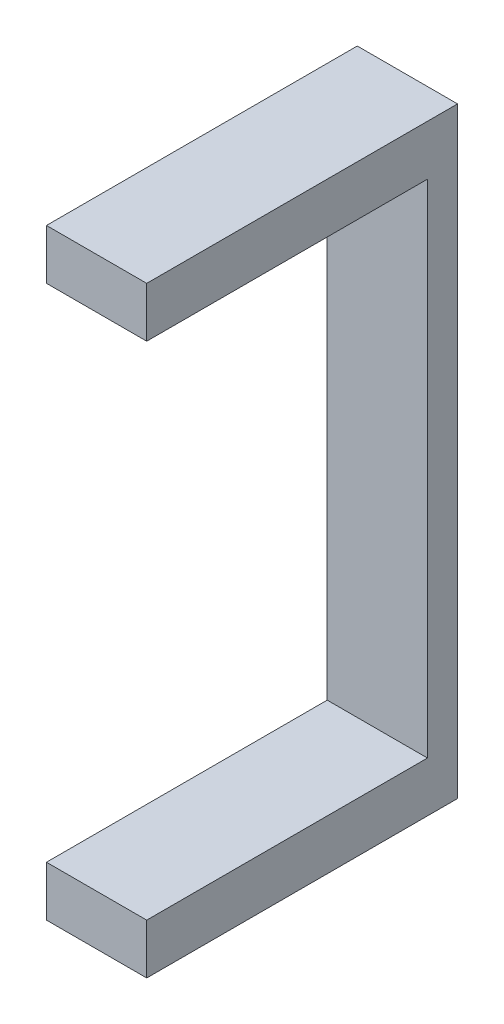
from build123d import *

# Parameters (mm, degrees)
HIDDEN_KEEPER_BONDING_FOOT_START    = 2.6
HIDDEN_KEEPER_BONDING_FOOT_SKETCH_W = 2
HIDDEN_KEEPER_BONDING_FOOT_SKETCH_H = 12
HIDDEN_KEEPER_BONDING_FOOT_DEPTH    = 0.6
BUTTON_TRAVEL_STOP_5_5_START        = 3.2
BUTTON_TRAVEL_STOP_5_5_SKETCH_W     = 2
BUTTON_TRAVEL_STOP_5_5_SKETCH_H     = 1
BUTTON_TRAVEL_STOP_5_5_DEPTH        = 5.6
BUTTON_TRAVEL_STOP_5_5_SKETCH_2_W   = 2
BUTTON_TRAVEL_STOP_5_5_SKETCH_2_H   = 1
BUTTON_TRAVEL_STOP_5_5_2_DEPTH      = 5.6


with BuildPart() as part:
    # Hidden_keeper_bonding_foot_Sketch → Hidden_keeper_bonding_foot (new body)
    with BuildSketch(Plane.XY.offset(HIDDEN_KEEPER_BONDING_FOOT_START)):
        with Locations((-26.15, 0)):
            Rectangle(HIDDEN_KEEPER_BONDING_FOOT_SKETCH_W, HIDDEN_KEEPER_BONDING_FOOT_SKETCH_H)
    extrude(amount=HIDDEN_KEEPER_BONDING_FOOT_DEPTH)

    # Button_travel_stop_-5.5_Sketch → Button_travel_stop_-5.5 (add)
    with BuildSketch(Plane.XY.offset(BUTTON_TRAVEL_STOP_5_5_START)):
        with Locations((-26.15, -5.5)):
            Rectangle(BUTTON_TRAVEL_STOP_5_5_SKETCH_W, BUTTON_TRAVEL_STOP_5_5_SKETCH_H)
    extrude(amount=BUTTON_TRAVEL_STOP_5_5_DEPTH)

    # Button_travel_stop_5.5_Sketch 2 → Button_travel_stop_5.5 2 (add)
    with BuildSketch(Plane.XY.offset(BUTTON_TRAVEL_STOP_5_5_START)):
        with Locations((-26.15, 5.5)):
            Rectangle(BUTTON_TRAVEL_STOP_5_5_SKETCH_2_W, BUTTON_TRAVEL_STOP_5_5_SKETCH_2_H)
    extrude(amount=BUTTON_TRAVEL_STOP_5_5_2_DEPTH)


solid = part.part
